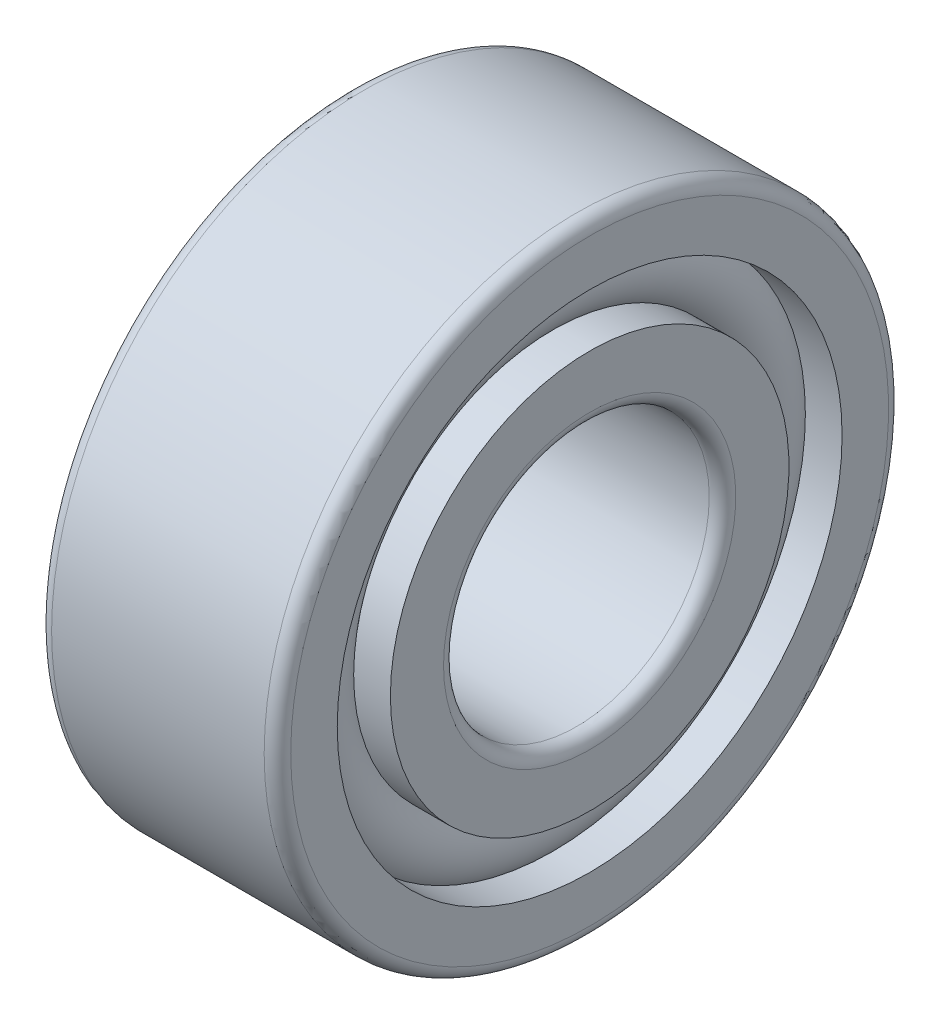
from build123d import *

# Parameters (mm, degrees)
CONG_1_R = 1


with BuildPart() as part:
    # Esquisse1 → R_volution1 (revolve)
    with BuildSketch(Plane.XY, mode=Mode.PRIVATE) as r_volution1_sk:
        with BuildLine():
            Line((0, 10), (0, 15))
            Line((0, 15), (2.763932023, 15))
            ThreePointArc((2.763932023, 15), (2, 17), (2.763932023, 19))
            Line((2.763932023, 19), (0, 19))
            Line((0, 19), (0, 23.5))
            Line((0, 23.5), (18, 23.5))
            Line((18, 23.5), (18, 19))
            Line((18, 19), (15.236067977, 19))
            ThreePointArc((15.236067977, 19), (16, 17), (15.236067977, 15))
            Line((15.236067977, 15), (18, 15))
            Line((18, 15), (18, 10))
            Line((18, 10), (0, 10))
        make_face()
    revolve(r_volution1_sk.sketch.rotate(Axis((-10.188583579, 0, 0), (1, 0, 0)), 90), axis=Axis((-10.188583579, 0, 0), (1, 0, 0)))

    # Cong_1
    cong_1_edges = [part.edges().sort_by_distance(p)[0] for p in [
        (0, 0, -23.5),
        (18, 0, -23.5),
        (18, 0, -10),
        (0, 0, -10),
    ]]
    fillet(cong_1_edges, radius=CONG_1_R)


solid = part.part
